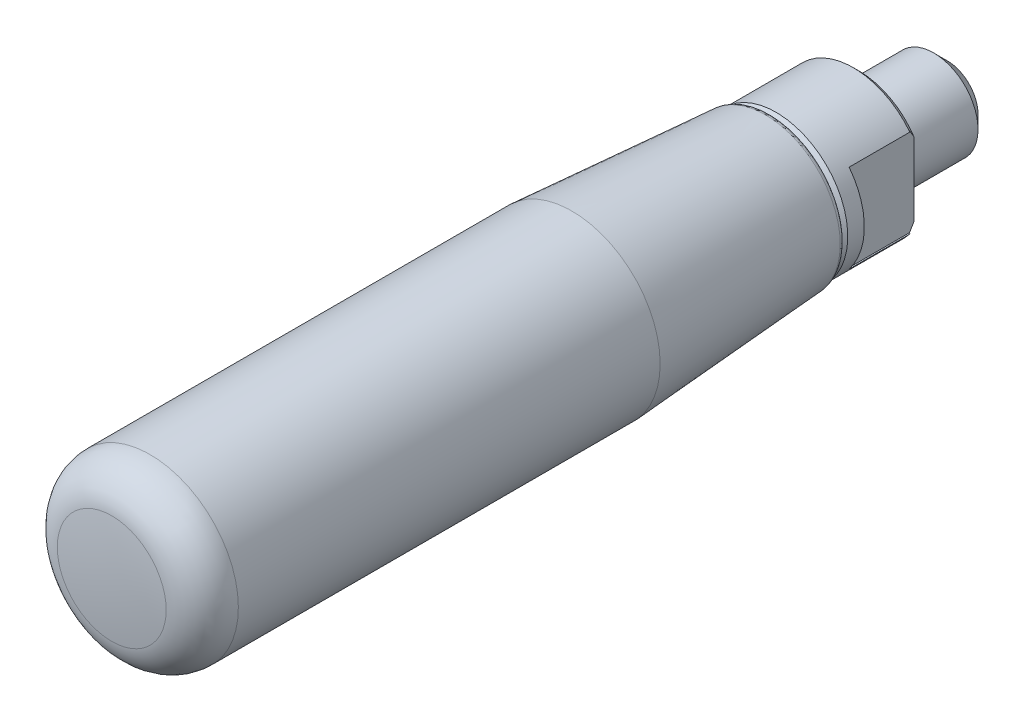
ISO-10303-21;
HEADER;
FILE_DESCRIPTION(('STEP AP214'),'2;1');
FILE_NAME('part.step','',(''),(''),'','','');
FILE_SCHEMA(('AUTOMOTIVE_DESIGN { 1 0 10303 214 1 1 1 1 }'));
ENDSEC;
DATA;
#1=APPLICATION_CONTEXT('core data for automotive mechanical design processes');
#2=APPLICATION_PROTOCOL_DEFINITION('international standard','automotive_design',2000,#1);
#3=PRODUCT_CONTEXT('',#1,'mechanical');
#4=PRODUCT('Part','Part','',(#3));
#5=PRODUCT_RELATED_PRODUCT_CATEGORY('part','',(#4));
#6=PRODUCT_DEFINITION_FORMATION('','',#4);
#7=PRODUCT_DEFINITION_CONTEXT('part definition',#1,'design');
#8=PRODUCT_DEFINITION('design','',#6,#7);
#9=PRODUCT_DEFINITION_SHAPE('','',#8);
#10=(LENGTH_UNIT() NAMED_UNIT(*) SI_UNIT(.MILLI.,.METRE.));
#11=(NAMED_UNIT(*) PLANE_ANGLE_UNIT() SI_UNIT($,.RADIAN.));
#12=(NAMED_UNIT(*) SI_UNIT($,.STERADIAN.) SOLID_ANGLE_UNIT());
#13=UNCERTAINTY_MEASURE_WITH_UNIT(LENGTH_MEASURE(1.E-05),#10,'distance_accuracy_value','');
#14=(GEOMETRIC_REPRESENTATION_CONTEXT(3) GLOBAL_UNCERTAINTY_ASSIGNED_CONTEXT((#13)) GLOBAL_UNIT_ASSIGNED_CONTEXT((#10,
#11,#12)) REPRESENTATION_CONTEXT('',''));
#15=CARTESIAN_POINT('',(0.,0.,0.));
#16=DIRECTION('',(0.,0.,1.));
#17=DIRECTION('',(1.,0.,0.));
#18=AXIS2_PLACEMENT_3D('',#15,#16,#17);
#19=CARTESIAN_POINT('',(0.,0.,28.));
#20=DIRECTION('',(0.,0.,-1.));
#21=DIRECTION('',(-0.819548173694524,0.573010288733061,0.));
#22=AXIS2_PLACEMENT_3D('',#19,#20,#21);
#23=SPHERICAL_SURFACE('',#22,40.);
#24=CARTESIAN_POINT('',(0.,0.,67.6948389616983));
#25=DIRECTION('',(0.,0.,-1.));
#26=DIRECTION('',(0.819548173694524,-0.573010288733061,0.));
#27=AXIS2_PLACEMENT_3D('',#24,#25,#26);
#28=CIRCLE('',#27,4.93150684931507);
#29=CARTESIAN_POINT('',(4.04160743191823,-2.82580416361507,67.6948389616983));
#30=VERTEX_POINT('',#29);
#31=EDGE_CURVE('E144',#30,#30,#28,.F.);
#32=ORIENTED_EDGE('',*,*,#31,.T.);
#33=EDGE_LOOP('',(#32));
#34=FACE_BOUND('',#33,.T.);
#35=ADVANCED_FACE('F15',(#34),#23,.T.);
#36=CARTESIAN_POINT('',(0.,0.,8.));
#37=DIRECTION('',(0.,0.,-1.));
#38=DIRECTION('',(0.819548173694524,-0.573010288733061,0.));
#39=AXIS2_PLACEMENT_3D('',#36,#37,#38);
#40=CYLINDRICAL_SURFACE('',#39,8.);
#41=CARTESIAN_POINT('',(0.,0.,64.2215405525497));
#42=DIRECTION('',(0.,0.,-1.));
#43=DIRECTION('',(0.819548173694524,-0.573010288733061,0.));
#44=AXIS2_PLACEMENT_3D('',#41,#42,#43);
#45=CIRCLE('',#44,8.);
#46=CARTESIAN_POINT('',(6.55638538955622,-4.58408230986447,64.2215405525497));
#47=VERTEX_POINT('',#46);
#48=EDGE_CURVE('E139',#47,#47,#45,.T.);
#49=ORIENTED_EDGE('',*,*,#48,.T.);
#50=EDGE_LOOP('',(#49));
#51=FACE_BOUND('',#50,.T.);
#52=CARTESIAN_POINT('',(0.,0.,26.));
#53=DIRECTION('',(0.,0.,-1.));
#54=DIRECTION('',(0.819548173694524,-0.573010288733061,0.));
#55=AXIS2_PLACEMENT_3D('',#52,#53,#54);
#56=CIRCLE('',#55,8.);
#57=CARTESIAN_POINT('',(6.5563853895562,-4.58408230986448,26.));
#58=VERTEX_POINT('',#57);
#59=EDGE_CURVE('E136',#58,#58,#56,.T.);
#60=ORIENTED_EDGE('',*,*,#59,.F.);
#61=EDGE_LOOP('',(#60));
#62=FACE_BOUND('',#61,.T.);
#63=ADVANCED_FACE('F494',(#51,#62),#40,.T.);
#64=CARTESIAN_POINT('',(0.,0.,26.));
#65=DIRECTION('',(0.,0.,1.));
#66=DIRECTION('',(-0.819548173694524,0.573010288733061,0.));
#67=AXIS2_PLACEMENT_3D('',#64,#65,#66);
#68=CONICAL_SURFACE('',#67,8.,0.0693331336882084);
#69=CARTESIAN_POINT('',(0.,0.,8.46536120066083));
#70=DIRECTION('',(0.,0.,-1.));
#71=DIRECTION('',(0.819548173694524,-0.573010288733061,0.));
#72=AXIS2_PLACEMENT_3D('',#69,#70,#71);
#73=CIRCLE('',#72,6.78231675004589);
#74=CARTESIAN_POINT('',(5.55843530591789,-3.88633727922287,8.46536120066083));
#75=VERTEX_POINT('',#74);
#76=EDGE_CURVE('E150',#75,#75,#73,.F.);
#77=ORIENTED_EDGE('',*,*,#76,.T.);
#78=EDGE_LOOP('',(#77));
#79=FACE_BOUND('',#78,.T.);
#80=ORIENTED_EDGE('',*,*,#59,.T.);
#81=EDGE_LOOP('',(#80));
#82=FACE_BOUND('',#81,.T.);
#83=ADVANCED_FACE('F501',(#79,#82),#68,.T.);
#84=CARTESIAN_POINT('',(-3.27819269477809,2.29204115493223,8.));
#85=DIRECTION('',(0.,0.,1.));
#86=DIRECTION('',(-0.819548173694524,0.573010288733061,0.));
#87=AXIS2_PLACEMENT_3D('',#84,#85,#86);
#88=PLANE('',#87);
#89=CARTESIAN_POINT('',(0.,0.,8.));
#90=DIRECTION('',(0.,0.,-1.));
#91=DIRECTION('',(-1.,0.,0.));
#92=AXIS2_PLACEMENT_3D('',#89,#90,#91);
#93=CIRCLE('',#92,6.);
#94=CARTESIAN_POINT('',(-6.,0.,8.));
#95=VERTEX_POINT('',#94);
#96=EDGE_CURVE('E225',#95,#95,#93,.F.);
#97=ORIENTED_EDGE('',*,*,#96,.T.);
#98=EDGE_LOOP('',(#97));
#99=FACE_BOUND('',#98,.T.);
#100=CARTESIAN_POINT('',(0.,0.,8.));
#101=DIRECTION('',(0.,0.,1.));
#102=DIRECTION('',(-0.819548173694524,0.573010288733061,0.));
#103=AXIS2_PLACEMENT_3D('',#100,#101,#102);
#104=CIRCLE('',#103,6.28351803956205);
#105=CARTESIAN_POINT('',(-5.14964573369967,3.60052048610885,8.));
#106=VERTEX_POINT('',#105);
#107=EDGE_CURVE('E147',#106,#106,#104,.F.);
#108=ORIENTED_EDGE('',*,*,#107,.T.);
#109=EDGE_LOOP('',(#108));
#110=FACE_BOUND('',#109,.T.);
#111=ADVANCED_FACE('F630',(#99,#110),#88,.F.);
#112=CARTESIAN_POINT('',(0.,0.,64.2215405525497));
#113=DIRECTION('',(0.,0.,-1.));
#114=DIRECTION('',(0.819548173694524,-0.573010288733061,0.));
#115=AXIS2_PLACEMENT_3D('',#112,#113,#114);
#116=TOROIDAL_SURFACE('',#115,4.5,3.5);
#117=ORIENTED_EDGE('',*,*,#31,.F.);
#118=EDGE_LOOP('',(#117));
#119=FACE_BOUND('',#118,.T.);
#120=ORIENTED_EDGE('',*,*,#48,.F.);
#121=EDGE_LOOP('',(#120));
#122=FACE_BOUND('',#121,.T.);
#123=ADVANCED_FACE('F620',(#119,#122),#116,.T.);
#124=CARTESIAN_POINT('',(0.,0.,8.5));
#125=DIRECTION('',(0.,0.,1.));
#126=DIRECTION('',(-0.819548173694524,0.573010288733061,0.));
#127=AXIS2_PLACEMENT_3D('',#124,#125,#126);
#128=TOROIDAL_SURFACE('',#127,6.28351803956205,0.5);
#129=ORIENTED_EDGE('',*,*,#76,.F.);
#130=EDGE_LOOP('',(#129));
#131=FACE_BOUND('',#130,.T.);
#132=ORIENTED_EDGE('',*,*,#107,.F.);
#133=EDGE_LOOP('',(#132));
#134=FACE_BOUND('',#133,.T.);
#135=ADVANCED_FACE('F346',(#131,#134),#128,.T.);
#136=CARTESIAN_POINT('',(0.,4.,-8.));
#137=DIRECTION('',(0.,0.,1.));
#138=DIRECTION('',(1.,0.,0.));
#139=AXIS2_PLACEMENT_3D('',#136,#137,#138);
#140=PLANE('',#139);
#141=CARTESIAN_POINT('',(0.,0.,-8.));
#142=DIRECTION('',(0.,0.,1.));
#143=DIRECTION('',(1.,0.,0.));
#144=AXIS2_PLACEMENT_3D('',#141,#142,#143);
#145=CIRCLE('',#144,2.8);
#146=CARTESIAN_POINT('',(2.8,0.,-8.));
#147=VERTEX_POINT('',#146);
#148=EDGE_CURVE('E448',#147,#147,#145,.F.);
#149=ORIENTED_EDGE('',*,*,#148,.T.);
#150=EDGE_LOOP('',(#149));
#151=FACE_BOUND('',#150,.T.);
#152=ADVANCED_FACE('F343',(#151),#140,.F.);
#153=CARTESIAN_POINT('',(0.,0.,-8.));
#154=DIRECTION('',(0.,0.,1.));
#155=DIRECTION('',(1.,0.,0.));
#156=AXIS2_PLACEMENT_3D('',#153,#154,#155);
#157=CONICAL_SURFACE('',#156,2.8,0.785398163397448);
#158=CARTESIAN_POINT('',(0.,0.,-6.8));
#159=DIRECTION('',(0.,0.,1.));
#160=DIRECTION('',(1.,0.,0.));
#161=AXIS2_PLACEMENT_3D('',#158,#159,#160);
#162=CIRCLE('',#161,4.);
#163=CARTESIAN_POINT('',(4.,0.,-6.8));
#164=VERTEX_POINT('',#163);
#165=EDGE_CURVE('E446',#164,#164,#162,.T.);
#166=ORIENTED_EDGE('',*,*,#165,.F.);
#167=EDGE_LOOP('',(#166));
#168=FACE_BOUND('',#167,.T.);
#169=ORIENTED_EDGE('',*,*,#148,.F.);
#170=EDGE_LOOP('',(#169));
#171=FACE_BOUND('',#170,.T.);
#172=ADVANCED_FACE('F260',(#168,#171),#157,.T.);
#173=CARTESIAN_POINT('',(0.,0.,0.));
#174=DIRECTION('',(0.,0.,-1.));
#175=DIRECTION('',(-1.,0.,0.));
#176=AXIS2_PLACEMENT_3D('',#173,#174,#175);
#177=CYLINDRICAL_SURFACE('',#176,4.);
#178=ORIENTED_EDGE('',*,*,#165,.T.);
#179=EDGE_LOOP('',(#178));
#180=FACE_BOUND('',#179,.T.);
#181=CARTESIAN_POINT('',(0.,0.,0.));
#182=DIRECTION('',(0.,0.,-1.));
#183=DIRECTION('',(-1.,0.,0.));
#184=AXIS2_PLACEMENT_3D('',#181,#182,#183);
#185=CIRCLE('',#184,4.);
#186=CARTESIAN_POINT('',(-4.,0.,0.));
#187=VERTEX_POINT('',#186);
#188=EDGE_CURVE('E192',#187,#187,#185,.T.);
#189=ORIENTED_EDGE('',*,*,#188,.T.);
#190=EDGE_LOOP('',(#189));
#191=FACE_BOUND('',#190,.T.);
#192=ADVANCED_FACE('F339',(#180,#191),#177,.T.);
#193=CARTESIAN_POINT('',(-5.,4.,6.));
#194=DIRECTION('',(-1.,0.,0.));
#195=DIRECTION('',(0.,-1.,0.));
#196=AXIS2_PLACEMENT_3D('',#193,#194,#195);
#197=PLANE('',#196);
#198=DIRECTION('',(0.,0.,-1.));
#199=VECTOR('',#198,1.);
#200=CARTESIAN_POINT('',(-5.,4.,6.));
#201=LINE('',#200,#199);
#202=CARTESIAN_POINT('',(-5.,4.,6.));
#203=VERTEX_POINT('',#202);
#204=CARTESIAN_POINT('',(-5.,4.,0.403124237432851));
#205=VERTEX_POINT('',#204);
#206=EDGE_CURVE('E173',#203,#205,#201,.T.);
#207=ORIENTED_EDGE('',*,*,#206,.T.);
#208=CARTESIAN_POINT('',(-5.,4.,0.403124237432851));
#209=CARTESIAN_POINT('',(-5.,3.94391314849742,0.368087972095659));
#210=CARTESIAN_POINT('',(-5.,3.88762458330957,0.33337321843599));
#211=CARTESIAN_POINT('',(-5.,3.77463206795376,0.264649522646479));
#212=CARTESIAN_POINT('',(-5.,3.71792819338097,0.230640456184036));
#213=CARTESIAN_POINT('',(-5.,3.60407215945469,0.163377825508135));
#214=CARTESIAN_POINT('',(-5.,3.54691999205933,0.13012427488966));
#215=CARTESIAN_POINT('',(-5.,3.43213562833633,0.0644325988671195));
#216=CARTESIAN_POINT('',(-5.,3.3745033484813,0.0319946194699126));
#217=CARTESIAN_POINT('',(-5.,3.31662479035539,0.));
#218=B_SPLINE_CURVE_WITH_KNOTS('',3,(#208,#209,#210,#211,#212,#213,#214,#215,#216,#217),
.UNSPECIFIED.,.F.,.F.,(4,2,2,2,4),(0.,0.198392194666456,0.396749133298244,0.595109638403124,
0.793505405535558),.UNSPECIFIED.);
#219=CARTESIAN_POINT('',(-5.,3.31662479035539,0.));
#220=VERTEX_POINT('',#219);
#221=EDGE_CURVE('E286',#205,#220,#218,.T.);
#222=ORIENTED_EDGE('',*,*,#221,.T.);
#223=DIRECTION('',(0.,1.,0.));
#224=VECTOR('',#223,1.);
#225=CARTESIAN_POINT('',(-5.,4.,0.));
#226=LINE('',#225,#224);
#227=CARTESIAN_POINT('',(-5.,-3.31662479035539,0.));
#228=VERTEX_POINT('',#227);
#229=EDGE_CURVE('E159',#228,#220,#226,.T.);
#230=ORIENTED_EDGE('',*,*,#229,.F.);
#231=CARTESIAN_POINT('',(-5.,-3.31662479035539,0.));
#232=CARTESIAN_POINT('',(-5.,-3.3745033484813,0.0319946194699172));
#233=CARTESIAN_POINT('',(-5.,-3.43213562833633,0.0644325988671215));
#234=CARTESIAN_POINT('',(-5.,-3.54691999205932,0.130124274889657));
#235=CARTESIAN_POINT('',(-5.,-3.60407215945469,0.16337782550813));
#236=CARTESIAN_POINT('',(-5.,-3.71792819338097,0.230640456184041));
#237=CARTESIAN_POINT('',(-5.,-3.77463206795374,0.264649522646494));
#238=CARTESIAN_POINT('',(-5.,-3.88762458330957,0.333373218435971));
#239=CARTESIAN_POINT('',(-5.,-3.94391314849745,0.368087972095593));
#240=CARTESIAN_POINT('',(-5.,-4.0000000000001,0.403124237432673));
#241=B_SPLINE_CURVE_WITH_KNOTS('',3,(#231,#232,#233,#234,#235,#236,#237,#238,#239,#240),
.UNSPECIFIED.,.F.,.F.,(4,2,2,2,4),(0.,0.198395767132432,0.396756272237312,0.595113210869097,
0.793505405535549),.UNSPECIFIED.);
#242=CARTESIAN_POINT('',(-5.,-4.,0.403124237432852));
#243=VERTEX_POINT('',#242);
#244=EDGE_CURVE('E270',#228,#243,#241,.T.);
#245=ORIENTED_EDGE('',*,*,#244,.T.);
#246=DIRECTION('',(0.,0.,-1.));
#247=VECTOR('',#246,1.);
#248=CARTESIAN_POINT('',(-5.,-4.,6.));
#249=LINE('',#248,#247);
#250=CARTESIAN_POINT('',(-5.,-4.,6.));
#251=VERTEX_POINT('',#250);
#252=EDGE_CURVE('E170',#251,#243,#249,.T.);
#253=ORIENTED_EDGE('',*,*,#252,.F.);
#254=DIRECTION('',(0.,1.,0.));
#255=VECTOR('',#254,1.);
#256=CARTESIAN_POINT('',(-5.,4.,6.));
#257=LINE('',#256,#255);
#258=EDGE_CURVE('E162',#251,#203,#257,.T.);
#259=ORIENTED_EDGE('',*,*,#258,.T.);
#260=EDGE_LOOP('',(#207,#222,#230,#245,#253,#259));
#261=FACE_BOUND('',#260,.T.);
#262=ADVANCED_FACE('F306',(#261),#197,.T.);
#263=CARTESIAN_POINT('',(0.,6.5,0.));
#264=DIRECTION('',(0.,0.,1.));
#265=DIRECTION('',(1.,0.,0.));
#266=AXIS2_PLACEMENT_3D('',#263,#264,#265);
#267=PLANE('',#266);
#268=ORIENTED_EDGE('',*,*,#188,.F.);
#269=EDGE_LOOP('',(#268));
#270=FACE_BOUND('',#269,.T.);
#271=ORIENTED_EDGE('',*,*,#229,.T.);
#272=CARTESIAN_POINT('',(0.,0.,0.));
#273=DIRECTION('',(0.,0.,1.));
#274=DIRECTION('',(1.,0.,0.));
#275=AXIS2_PLACEMENT_3D('',#272,#273,#274);
#276=CIRCLE('',#275,6.);
#277=CARTESIAN_POINT('',(5.,3.31662479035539,0.));
#278=VERTEX_POINT('',#277);
#279=EDGE_CURVE('E231',#220,#278,#276,.F.);
#280=ORIENTED_EDGE('',*,*,#279,.T.);
#281=DIRECTION('',(0.,-1.,0.));
#282=VECTOR('',#281,1.);
#283=CARTESIAN_POINT('',(5.,4.,0.));
#284=LINE('',#283,#282);
#285=CARTESIAN_POINT('',(5.,-3.31662479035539,0.));
#286=VERTEX_POINT('',#285);
#287=EDGE_CURVE('E176',#278,#286,#284,.T.);
#288=ORIENTED_EDGE('',*,*,#287,.T.);
#289=CARTESIAN_POINT('',(0.,0.,0.));
#290=DIRECTION('',(0.,0.,1.));
#291=DIRECTION('',(1.,0.,0.));
#292=AXIS2_PLACEMENT_3D('',#289,#290,#291);
#293=CIRCLE('',#292,6.);
#294=EDGE_CURVE('E228',#286,#228,#293,.F.);
#295=ORIENTED_EDGE('',*,*,#294,.T.);
#296=EDGE_LOOP('',(#271,#280,#288,#295));
#297=FACE_BOUND('',#296,.T.);
#298=ADVANCED_FACE('F335',(#270,#297),#267,.F.);
#299=CARTESIAN_POINT('',(5.,4.,6.));
#300=DIRECTION('',(1.,0.,0.));
#301=DIRECTION('',(0.,1.,0.));
#302=AXIS2_PLACEMENT_3D('',#299,#300,#301);
#303=PLANE('',#302);
#304=ORIENTED_EDGE('',*,*,#287,.F.);
#305=CARTESIAN_POINT('',(5.,3.31662479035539,0.));
#306=CARTESIAN_POINT('',(5.,3.3745033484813,0.0319946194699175));
#307=CARTESIAN_POINT('',(5.,3.43213562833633,0.0644325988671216));
#308=CARTESIAN_POINT('',(5.,3.54691999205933,0.130124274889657));
#309=CARTESIAN_POINT('',(5.,3.60407215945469,0.16337782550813));
#310=CARTESIAN_POINT('',(5.,3.71792819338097,0.230640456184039));
#311=CARTESIAN_POINT('',(5.,3.77463206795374,0.264649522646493));
#312=CARTESIAN_POINT('',(5.,3.88762458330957,0.333373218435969));
#313=CARTESIAN_POINT('',(5.,3.94391314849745,0.368087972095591));
#314=CARTESIAN_POINT('',(5.,4.0000000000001,0.403124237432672));
#315=B_SPLINE_CURVE_WITH_KNOTS('',3,(#305,#306,#307,#308,#309,#310,#311,#312,#313,#314),
.UNSPECIFIED.,.F.,.F.,(4,2,2,2,4),(0.,0.198395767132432,0.396756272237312,0.595113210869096,
0.793505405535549),.UNSPECIFIED.);
#316=CARTESIAN_POINT('',(5.,4.,0.403124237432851));
#317=VERTEX_POINT('',#316);
#318=EDGE_CURVE('E242',#278,#317,#315,.T.);
#319=ORIENTED_EDGE('',*,*,#318,.T.);
#320=DIRECTION('',(0.,0.,-1.));
#321=VECTOR('',#320,1.);
#322=CARTESIAN_POINT('',(5.,4.,6.));
#323=LINE('',#322,#321);
#324=CARTESIAN_POINT('',(5.,4.,6.));
#325=VERTEX_POINT('',#324);
#326=EDGE_CURVE('E189',#325,#317,#323,.T.);
#327=ORIENTED_EDGE('',*,*,#326,.F.);
#328=DIRECTION('',(0.,-1.,0.));
#329=VECTOR('',#328,1.);
#330=CARTESIAN_POINT('',(5.,4.,6.));
#331=LINE('',#330,#329);
#332=CARTESIAN_POINT('',(5.,-4.,6.));
#333=VERTEX_POINT('',#332);
#334=EDGE_CURVE('E181',#325,#333,#331,.T.);
#335=ORIENTED_EDGE('',*,*,#334,.T.);
#336=DIRECTION('',(0.,0.,-1.));
#337=VECTOR('',#336,1.);
#338=CARTESIAN_POINT('',(5.,-4.,6.));
#339=LINE('',#338,#337);
#340=CARTESIAN_POINT('',(5.,-4.,0.403124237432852));
#341=VERTEX_POINT('',#340);
#342=EDGE_CURVE('E186',#333,#341,#339,.T.);
#343=ORIENTED_EDGE('',*,*,#342,.T.);
#344=CARTESIAN_POINT('',(5.,-4.,0.403124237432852));
#345=CARTESIAN_POINT('',(5.,-3.94391314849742,0.36808797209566));
#346=CARTESIAN_POINT('',(5.,-3.88762458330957,0.333373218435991));
#347=CARTESIAN_POINT('',(5.,-3.77463206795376,0.264649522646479));
#348=CARTESIAN_POINT('',(5.,-3.71792819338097,0.230640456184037));
#349=CARTESIAN_POINT('',(5.,-3.60407215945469,0.163377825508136));
#350=CARTESIAN_POINT('',(5.,-3.54691999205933,0.130124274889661));
#351=CARTESIAN_POINT('',(5.,-3.43213562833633,0.0644325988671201));
#352=CARTESIAN_POINT('',(5.,-3.3745033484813,0.0319946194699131));
#353=CARTESIAN_POINT('',(5.,-3.31662479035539,0.));
#354=B_SPLINE_CURVE_WITH_KNOTS('',3,(#344,#345,#346,#347,#348,#349,#350,#351,#352,#353),
.UNSPECIFIED.,.F.,.F.,(4,2,2,2,4),(0.,0.198392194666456,0.396749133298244,0.595109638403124,
0.793505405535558),.UNSPECIFIED.);
#355=EDGE_CURVE('E234',#341,#286,#354,.T.);
#356=ORIENTED_EDGE('',*,*,#355,.T.);
#357=EDGE_LOOP('',(#304,#319,#327,#335,#343,#356));
#358=FACE_BOUND('',#357,.T.);
#359=ADVANCED_FACE('F249',(#358),#303,.T.);
#360=CARTESIAN_POINT('',(5.,4.,6.));
#361=DIRECTION('',(0.,0.,-1.));
#362=DIRECTION('',(0.,-1.,0.));
#363=AXIS2_PLACEMENT_3D('',#360,#361,#362);
#364=PLANE('',#363);
#365=CARTESIAN_POINT('',(0.,0.,6.));
#366=DIRECTION('',(0.,0.,-1.));
#367=DIRECTION('',(0.,-1.,0.));
#368=AXIS2_PLACEMENT_3D('',#365,#366,#367);
#369=CIRCLE('',#368,6.5);
#370=CARTESIAN_POINT('',(5.1234753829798,4.,6.));
#371=VERTEX_POINT('',#370);
#372=CARTESIAN_POINT('',(5.1234753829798,-4.,6.));
#373=VERTEX_POINT('',#372);
#374=EDGE_CURVE('E204',#371,#373,#369,.T.);
#375=ORIENTED_EDGE('',*,*,#374,.T.);
#376=DIRECTION('',(1.,0.,0.));
#377=VECTOR('',#376,1.);
#378=CARTESIAN_POINT('',(5.,-4.,6.));
#379=LINE('',#378,#377);
#380=EDGE_CURVE('E183',#333,#373,#379,.T.);
#381=ORIENTED_EDGE('',*,*,#380,.F.);
#382=ORIENTED_EDGE('',*,*,#334,.F.);
#383=DIRECTION('',(-1.,0.,0.));
#384=VECTOR('',#383,1.);
#385=CARTESIAN_POINT('',(5.,4.,6.));
#386=LINE('',#385,#384);
#387=EDGE_CURVE('E179',#371,#325,#386,.T.);
#388=ORIENTED_EDGE('',*,*,#387,.F.);
#389=EDGE_LOOP('',(#375,#381,#382,#388));
#390=FACE_BOUND('',#389,.T.);
#391=ADVANCED_FACE('F486',(#390),#364,.T.);
#392=CARTESIAN_POINT('',(5.,-4.,6.));
#393=DIRECTION('',(0.,1.,0.));
#394=DIRECTION('',(0.,0.,-1.));
#395=AXIS2_PLACEMENT_3D('',#392,#393,#394);
#396=PLANE('',#395);
#397=DIRECTION('',(0.,0.,-1.));
#398=VECTOR('',#397,1.);
#399=CARTESIAN_POINT('',(5.1234753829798,-4.,0.));
#400=LINE('',#399,#398);
#401=CARTESIAN_POINT('',(5.1234753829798,-4.,0.5));
#402=VERTEX_POINT('',#401);
#403=EDGE_CURVE('E206',#373,#402,#400,.T.);
#404=ORIENTED_EDGE('',*,*,#403,.T.);
#405=CARTESIAN_POINT('',(5.1234753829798,-4.,0.5));
#406=CARTESIAN_POINT('',(5.10293291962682,-4.,0.483807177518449));
#407=CARTESIAN_POINT('',(5.08237207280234,-4.,0.467637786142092));
#408=CARTESIAN_POINT('',(5.04121361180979,-4.,0.435345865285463));
#409=CARTESIAN_POINT('',(5.020615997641,-4.,0.419223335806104));
#410=CARTESIAN_POINT('',(5.,-4.,0.403124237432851));
#411=B_SPLINE_CURVE_WITH_KNOTS('',3,(#405,#406,#407,#408,#409,#410),.UNSPECIFIED.,.F.,.F.,(4,2,
4),(0.,0.0784715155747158,0.156943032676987),.UNSPECIFIED.);
#412=EDGE_CURVE('E285',#402,#341,#411,.T.);
#413=ORIENTED_EDGE('',*,*,#412,.T.);
#414=ORIENTED_EDGE('',*,*,#342,.F.);
#415=ORIENTED_EDGE('',*,*,#380,.T.);
#416=EDGE_LOOP('',(#404,#413,#414,#415));
#417=FACE_BOUND('',#416,.T.);
#418=ADVANCED_FACE('F258',(#417),#396,.T.);
#419=CARTESIAN_POINT('',(0.,0.,0.));
#420=DIRECTION('',(0.,0.,1.));
#421=DIRECTION('',(1.,0.,0.));
#422=AXIS2_PLACEMENT_3D('',#419,#420,#421);
#423=CONICAL_SURFACE('',#422,6.,0.785398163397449);
#424=ORIENTED_EDGE('',*,*,#412,.F.);
#425=CARTESIAN_POINT('',(0.,0.,0.5));
#426=DIRECTION('',(0.,0.,1.));
#427=DIRECTION('',(1.,0.,0.));
#428=AXIS2_PLACEMENT_3D('',#425,#426,#427);
#429=CIRCLE('',#428,6.5);
#430=CARTESIAN_POINT('',(-5.1234753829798,-4.,0.5));
#431=VERTEX_POINT('',#430);
#432=EDGE_CURVE('E218',#431,#402,#429,.T.);
#433=ORIENTED_EDGE('',*,*,#432,.F.);
#434=CARTESIAN_POINT('',(-5.,-4.,0.403124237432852));
#435=CARTESIAN_POINT('',(-5.020615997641,-4.,0.419223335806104));
#436=CARTESIAN_POINT('',(-5.04121361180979,-4.,0.435345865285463));
#437=CARTESIAN_POINT('',(-5.08237207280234,-4.,0.467637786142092));
#438=CARTESIAN_POINT('',(-5.10293291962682,-4.,0.483807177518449));
#439=CARTESIAN_POINT('',(-5.1234753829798,-4.,0.5));
#440=B_SPLINE_CURVE_WITH_KNOTS('',3,(#434,#435,#436,#437,#438,#439),.UNSPECIFIED.,.F.,.F.,(4,2,
4),(0.,0.0784715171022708,0.156943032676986),.UNSPECIFIED.);
#441=EDGE_CURVE('E279',#243,#431,#440,.T.);
#442=ORIENTED_EDGE('',*,*,#441,.F.);
#443=ORIENTED_EDGE('',*,*,#244,.F.);
#444=ORIENTED_EDGE('',*,*,#294,.F.);
#445=ORIENTED_EDGE('',*,*,#355,.F.);
#446=EDGE_LOOP('',(#424,#433,#442,#443,#444,#445));
#447=FACE_BOUND('',#446,.T.);
#448=ADVANCED_FACE('F253',(#447),#423,.T.);
#449=CARTESIAN_POINT('',(-5.,-4.,6.));
#450=DIRECTION('',(0.,1.,0.));
#451=DIRECTION('',(0.,0.,-1.));
#452=AXIS2_PLACEMENT_3D('',#449,#450,#451);
#453=PLANE('',#452);
#454=ORIENTED_EDGE('',*,*,#252,.T.);
#455=ORIENTED_EDGE('',*,*,#441,.T.);
#456=DIRECTION('',(0.,0.,-1.));
#457=VECTOR('',#456,1.);
#458=CARTESIAN_POINT('',(-5.1234753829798,-4.,0.));
#459=LINE('',#458,#457);
#460=CARTESIAN_POINT('',(-5.1234753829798,-4.,6.));
#461=VERTEX_POINT('',#460);
#462=EDGE_CURVE('E213',#431,#461,#459,.F.);
#463=ORIENTED_EDGE('',*,*,#462,.T.);
#464=DIRECTION('',(1.,0.,0.));
#465=VECTOR('',#464,1.);
#466=CARTESIAN_POINT('',(-5.,-4.,6.));
#467=LINE('',#466,#465);
#468=EDGE_CURVE('E168',#461,#251,#467,.T.);
#469=ORIENTED_EDGE('',*,*,#468,.T.);
#470=EDGE_LOOP('',(#454,#455,#463,#469));
#471=FACE_BOUND('',#470,.T.);
#472=ADVANCED_FACE('F257',(#471),#453,.T.);
#473=CARTESIAN_POINT('',(-5.,-4.,6.));
#474=DIRECTION('',(0.,0.,-1.));
#475=DIRECTION('',(0.,-1.,0.));
#476=AXIS2_PLACEMENT_3D('',#473,#474,#475);
#477=PLANE('',#476);
#478=CARTESIAN_POINT('',(0.,0.,6.));
#479=DIRECTION('',(0.,0.,-1.));
#480=DIRECTION('',(0.,-1.,0.));
#481=AXIS2_PLACEMENT_3D('',#478,#479,#480);
#482=CIRCLE('',#481,6.5);
#483=CARTESIAN_POINT('',(-5.1234753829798,4.,6.));
#484=VERTEX_POINT('',#483);
#485=EDGE_CURVE('E211',#461,#484,#482,.T.);
#486=ORIENTED_EDGE('',*,*,#485,.T.);
#487=DIRECTION('',(-1.,0.,0.));
#488=VECTOR('',#487,1.);
#489=CARTESIAN_POINT('',(-5.,4.,6.));
#490=LINE('',#489,#488);
#491=EDGE_CURVE('E165',#203,#484,#490,.T.);
#492=ORIENTED_EDGE('',*,*,#491,.F.);
#493=ORIENTED_EDGE('',*,*,#258,.F.);
#494=ORIENTED_EDGE('',*,*,#468,.F.);
#495=EDGE_LOOP('',(#486,#492,#493,#494));
#496=FACE_BOUND('',#495,.T.);
#497=ADVANCED_FACE('F300',(#496),#477,.T.);
#498=CARTESIAN_POINT('',(-5.,4.,6.));
#499=DIRECTION('',(0.,-1.,0.));
#500=DIRECTION('',(0.,0.,1.));
#501=AXIS2_PLACEMENT_3D('',#498,#499,#500);
#502=PLANE('',#501);
#503=DIRECTION('',(0.,0.,-1.));
#504=VECTOR('',#503,1.);
#505=CARTESIAN_POINT('',(-5.1234753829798,4.,0.));
#506=LINE('',#505,#504);
#507=CARTESIAN_POINT('',(-5.1234753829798,4.,0.5));
#508=VERTEX_POINT('',#507);
#509=EDGE_CURVE('E215',#484,#508,#506,.T.);
#510=ORIENTED_EDGE('',*,*,#509,.T.);
#511=CARTESIAN_POINT('',(-5.1234753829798,4.,0.5));
#512=CARTESIAN_POINT('',(-5.10293291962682,4.,0.483807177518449));
#513=CARTESIAN_POINT('',(-5.08237207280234,4.,0.467637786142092));
#514=CARTESIAN_POINT('',(-5.04121361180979,4.,0.435345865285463));
#515=CARTESIAN_POINT('',(-5.020615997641,4.,0.419223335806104));
#516=CARTESIAN_POINT('',(-5.,4.,0.403124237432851));
#517=B_SPLINE_CURVE_WITH_KNOTS('',3,(#511,#512,#513,#514,#515,#516),.UNSPECIFIED.,.F.,.F.,(4,2,
4),(0.,0.0784715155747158,0.156943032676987),.UNSPECIFIED.);
#518=EDGE_CURVE('E309',#508,#205,#517,.T.);
#519=ORIENTED_EDGE('',*,*,#518,.T.);
#520=ORIENTED_EDGE('',*,*,#206,.F.);
#521=ORIENTED_EDGE('',*,*,#491,.T.);
#522=EDGE_LOOP('',(#510,#519,#520,#521));
#523=FACE_BOUND('',#522,.T.);
#524=ADVANCED_FACE('F302',(#523),#502,.T.);
#525=CARTESIAN_POINT('',(0.,0.,0.));
#526=DIRECTION('',(0.,0.,1.));
#527=DIRECTION('',(1.,0.,0.));
#528=AXIS2_PLACEMENT_3D('',#525,#526,#527);
#529=CONICAL_SURFACE('',#528,6.,0.785398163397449);
#530=ORIENTED_EDGE('',*,*,#518,.F.);
#531=CARTESIAN_POINT('',(0.,0.,0.5));
#532=DIRECTION('',(0.,0.,1.));
#533=DIRECTION('',(1.,0.,0.));
#534=AXIS2_PLACEMENT_3D('',#531,#532,#533);
#535=CIRCLE('',#534,6.5);
#536=CARTESIAN_POINT('',(5.1234753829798,4.,0.5));
#537=VERTEX_POINT('',#536);
#538=EDGE_CURVE('E220',#537,#508,#535,.T.);
#539=ORIENTED_EDGE('',*,*,#538,.F.);
#540=CARTESIAN_POINT('',(5.,4.,0.403124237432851));
#541=CARTESIAN_POINT('',(5.020615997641,4.,0.419223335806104));
#542=CARTESIAN_POINT('',(5.04121361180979,4.,0.435345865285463));
#543=CARTESIAN_POINT('',(5.08237207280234,4.,0.467637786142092));
#544=CARTESIAN_POINT('',(5.10293291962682,4.,0.483807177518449));
#545=CARTESIAN_POINT('',(5.1234753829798,4.,0.5));
#546=B_SPLINE_CURVE_WITH_KNOTS('',3,(#540,#541,#542,#543,#544,#545),.UNSPECIFIED.,.F.,.F.,(4,2,
4),(0.,0.078471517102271,0.156943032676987),.UNSPECIFIED.);
#547=EDGE_CURVE('E314',#317,#537,#546,.T.);
#548=ORIENTED_EDGE('',*,*,#547,.F.);
#549=ORIENTED_EDGE('',*,*,#318,.F.);
#550=ORIENTED_EDGE('',*,*,#279,.F.);
#551=ORIENTED_EDGE('',*,*,#221,.F.);
#552=EDGE_LOOP('',(#530,#539,#548,#549,#550,#551));
#553=FACE_BOUND('',#552,.T.);
#554=ADVANCED_FACE('F262',(#553),#529,.T.);
#555=CARTESIAN_POINT('',(5.,4.,6.));
#556=DIRECTION('',(0.,-1.,0.));
#557=DIRECTION('',(0.,0.,1.));
#558=AXIS2_PLACEMENT_3D('',#555,#556,#557);
#559=PLANE('',#558);
#560=ORIENTED_EDGE('',*,*,#326,.T.);
#561=ORIENTED_EDGE('',*,*,#547,.T.);
#562=DIRECTION('',(0.,0.,-1.));
#563=VECTOR('',#562,1.);
#564=CARTESIAN_POINT('',(5.1234753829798,4.,0.));
#565=LINE('',#564,#563);
#566=EDGE_CURVE('E209',#537,#371,#565,.F.);
#567=ORIENTED_EDGE('',*,*,#566,.T.);
#568=ORIENTED_EDGE('',*,*,#387,.T.);
#569=EDGE_LOOP('',(#560,#561,#567,#568));
#570=FACE_BOUND('',#569,.T.);
#571=ADVANCED_FACE('F319',(#570),#559,.T.);
#572=CARTESIAN_POINT('',(0.,0.,0.));
#573=DIRECTION('',(0.,0.,-1.));
#574=DIRECTION('',(-1.,0.,0.));
#575=AXIS2_PLACEMENT_3D('',#572,#573,#574);
#576=CYLINDRICAL_SURFACE('',#575,6.5);
#577=CARTESIAN_POINT('',(0.,0.,7.5));
#578=DIRECTION('',(0.,0.,-1.));
#579=DIRECTION('',(-1.,0.,0.));
#580=AXIS2_PLACEMENT_3D('',#577,#578,#579);
#581=CIRCLE('',#580,6.5);
#582=CARTESIAN_POINT('',(-6.5,0.,7.5));
#583=VERTEX_POINT('',#582);
#584=EDGE_CURVE('E222',#583,#583,#581,.T.);
#585=ORIENTED_EDGE('',*,*,#584,.T.);
#586=EDGE_LOOP('',(#585));
#587=FACE_BOUND('',#586,.T.);
#588=ORIENTED_EDGE('',*,*,#566,.F.);
#589=ORIENTED_EDGE('',*,*,#538,.T.);
#590=ORIENTED_EDGE('',*,*,#509,.F.);
#591=ORIENTED_EDGE('',*,*,#485,.F.);
#592=ORIENTED_EDGE('',*,*,#462,.F.);
#593=ORIENTED_EDGE('',*,*,#432,.T.);
#594=ORIENTED_EDGE('',*,*,#403,.F.);
#595=ORIENTED_EDGE('',*,*,#374,.F.);
#596=EDGE_LOOP('',(#588,#589,#590,#591,#592,#593,#594,#595));
#597=FACE_BOUND('',#596,.T.);
#598=ADVANCED_FACE('F323',(#587,#597),#576,.T.);
#599=CARTESIAN_POINT('',(0.,0.,7.5));
#600=DIRECTION('',(0.,0.,-1.));
#601=DIRECTION('',(-1.,0.,0.));
#602=AXIS2_PLACEMENT_3D('',#599,#600,#601);
#603=CONICAL_SURFACE('',#602,6.5,0.785398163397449);
#604=ORIENTED_EDGE('',*,*,#96,.F.);
#605=EDGE_LOOP('',(#604));
#606=FACE_BOUND('',#605,.T.);
#607=ORIENTED_EDGE('',*,*,#584,.F.);
#608=EDGE_LOOP('',(#607));
#609=FACE_BOUND('',#608,.T.);
#610=ADVANCED_FACE('F333',(#606,#609),#603,.T.);
#611=CLOSED_SHELL('',(#35,#63,#83,#111,#123,#135,#152,#172,#192,#262,#298,#359,#391,#418,#448,
#472,#497,#524,#554,#571,#598,#610));
#612=CARTESIAN_POINT('',(0.,0.,35.));
#613=DIRECTION('',(0.,0.,-1.));
#614=DIRECTION('',(0.417533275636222,0.90866163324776,0.));
#615=AXIS2_PLACEMENT_3D('',#612,#613,#614);
#616=CYLINDRICAL_SURFACE('',#615,2.4);
#617=CARTESIAN_POINT('',(0.,0.,35.));
#618=DIRECTION('',(0.,0.,-1.));
#619=DIRECTION('',(0.417533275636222,0.90866163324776,0.));
#620=AXIS2_PLACEMENT_3D('',#617,#618,#619);
#621=CIRCLE('',#620,2.4);
#622=CARTESIAN_POINT('',(1.70653881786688,-1.68752044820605,35.));
#623=VERTEX_POINT('',#622);
#624=CARTESIAN_POINT('',(2.18078791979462,-1.00207986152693,35.));
#625=VERTEX_POINT('',#624);
#626=EDGE_CURVE('E9',#623,#625,#621,.T.);
#627=ORIENTED_EDGE('',*,*,#626,.T.);
#628=DIRECTION('',(0.,0.,1.));
#629=VECTOR('',#628,1.);
#630=CARTESIAN_POINT('',(2.18078791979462,-1.00207986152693,35.));
#631=LINE('',#630,#629);
#632=CARTESIAN_POINT('',(2.18078791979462,-1.00207986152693,51.));
#633=VERTEX_POINT('',#632);
#634=EDGE_CURVE('E422',#625,#633,#631,.T.);
#635=ORIENTED_EDGE('',*,*,#634,.T.);
#636=CARTESIAN_POINT('',(0.,0.,51.));
#637=DIRECTION('',(0.,0.,-1.));
#638=DIRECTION('',(0.417533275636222,0.90866163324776,0.));
#639=AXIS2_PLACEMENT_3D('',#636,#637,#638);
#640=CIRCLE('',#639,2.4);
#641=CARTESIAN_POINT('',(1.70653881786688,-1.68752044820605,51.));
#642=VERTEX_POINT('',#641);
#643=EDGE_CURVE('E394',#642,#633,#640,.T.);
#644=ORIENTED_EDGE('',*,*,#643,.F.);
#645=DIRECTION('',(0.,0.,1.));
#646=VECTOR('',#645,1.);
#647=CARTESIAN_POINT('',(1.70653881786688,-1.68752044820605,35.));
#648=LINE('',#647,#646);
#649=EDGE_CURVE('E400',#623,#642,#648,.T.);
#650=ORIENTED_EDGE('',*,*,#649,.F.);
#651=EDGE_LOOP('',(#627,#635,#644,#650));
#652=FACE_BOUND('',#651,.T.);
#653=ADVANCED_FACE('F380',(#652),#616,.F.);
#654=CARTESIAN_POINT('',(1.70653881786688,-1.68752044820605,35.));
#655=DIRECTION('',(0.,0.,1.));
#656=DIRECTION('',(-0.417533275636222,-0.90866163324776,0.));
#657=AXIS2_PLACEMENT_3D('',#654,#655,#656);
#658=PLANE('',#657);
#659=DIRECTION('',(-0.90866163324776,0.417533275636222,0.));
#660=VECTOR('',#659,1.);
#661=CARTESIAN_POINT('',(2.18078791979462,-1.00207986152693,35.));
#662=LINE('',#661,#660);
#663=CARTESIAN_POINT('',(3.63464653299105,-1.67013310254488,35.));
#664=VERTEX_POINT('',#663);
#665=CARTESIAN_POINT('',(3.13488263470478,-1.44048980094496,35.));
#666=VERTEX_POINT('',#665);
#667=EDGE_CURVE('E406',#664,#666,#662,.T.);
#668=ORIENTED_EDGE('',*,*,#667,.T.);
#669=CARTESIAN_POINT('',(0.,0.,35.));
#670=DIRECTION('',(0.,0.,-1.));
#671=DIRECTION('',(-1.,0.,0.));
#672=AXIS2_PLACEMENT_3D('',#669,#670,#671);
#673=CIRCLE('',#672,3.45);
#674=CARTESIAN_POINT('',(2.45314955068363,-2.42581064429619,35.));
#675=VERTEX_POINT('',#674);
#676=EDGE_CURVE('E31',#666,#675,#673,.F.);
#677=ORIENTED_EDGE('',*,*,#676,.T.);
#678=DIRECTION('',(-0.711057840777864,0.703133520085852,0.));
#679=VECTOR('',#678,1.);
#680=CARTESIAN_POINT('',(1.70653881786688,-1.68752044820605,35.));
#681=LINE('',#680,#679);
#682=CARTESIAN_POINT('',(2.84423136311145,-2.81253408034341,35.));
#683=VERTEX_POINT('',#682);
#684=EDGE_CURVE('E412',#683,#675,#681,.T.);
#685=ORIENTED_EDGE('',*,*,#684,.F.);
#686=CARTESIAN_POINT('',(0.,0.,35.));
#687=DIRECTION('',(0.,0.,-1.));
#688=DIRECTION('',(0.417533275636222,0.90866163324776,0.));
#689=AXIS2_PLACEMENT_3D('',#686,#687,#688);
#690=CIRCLE('',#689,4.);
#691=EDGE_CURVE('E24',#683,#664,#690,.T.);
#692=ORIENTED_EDGE('',*,*,#691,.T.);
#693=EDGE_LOOP('',(#668,#677,#685,#692));
#694=FACE_BOUND('',#693,.T.);
#695=ADVANCED_FACE('F17',(#694),#658,.F.);
#696=CARTESIAN_POINT('',(2.84423136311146,-2.81253408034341,51.));
#697=DIRECTION('',(0.,0.,-1.));
#698=DIRECTION('',(0.417533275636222,0.90866163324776,0.));
#699=AXIS2_PLACEMENT_3D('',#696,#697,#698);
#700=PLANE('',#699);
#701=DIRECTION('',(0.711057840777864,-0.703133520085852,0.));
#702=VECTOR('',#701,1.);
#703=CARTESIAN_POINT('',(2.84423136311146,-2.81253408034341,51.));
#704=LINE('',#703,#702);
#705=CARTESIAN_POINT('',(2.84423136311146,-2.81253408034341,51.));
#706=VERTEX_POINT('',#705);
#707=EDGE_CURVE('E392',#642,#706,#704,.T.);
#708=ORIENTED_EDGE('',*,*,#707,.F.);
#709=ORIENTED_EDGE('',*,*,#643,.T.);
#710=DIRECTION('',(0.90866163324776,-0.417533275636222,0.));
#711=VECTOR('',#710,1.);
#712=CARTESIAN_POINT('',(3.63464653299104,-1.67013310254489,51.));
#713=LINE('',#712,#711);
#714=CARTESIAN_POINT('',(3.63464653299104,-1.67013310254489,51.));
#715=VERTEX_POINT('',#714);
#716=EDGE_CURVE('E421',#633,#715,#713,.T.);
#717=ORIENTED_EDGE('',*,*,#716,.T.);
#718=CARTESIAN_POINT('',(0.,0.,51.));
#719=DIRECTION('',(0.,0.,-1.));
#720=DIRECTION('',(0.417533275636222,0.90866163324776,0.));
#721=AXIS2_PLACEMENT_3D('',#718,#719,#720);
#722=CIRCLE('',#721,4.);
#723=EDGE_CURVE('E397',#706,#715,#722,.T.);
#724=ORIENTED_EDGE('',*,*,#723,.F.);
#725=EDGE_LOOP('',(#708,#709,#717,#724));
#726=FACE_BOUND('',#725,.T.);
#727=ADVANCED_FACE('F376',(#726),#700,.F.);
#728=CARTESIAN_POINT('',(1.70653881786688,-1.68752044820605,51.));
#729=DIRECTION('',(-0.703133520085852,-0.711057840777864,0.));
#730=DIRECTION('',(0.,0.,-1.));
#731=AXIS2_PLACEMENT_3D('',#728,#729,#730);
#732=PLANE('',#731);
#733=ORIENTED_EDGE('',*,*,#649,.T.);
#734=ORIENTED_EDGE('',*,*,#707,.T.);
#735=DIRECTION('',(0.,0.,-1.));
#736=VECTOR('',#735,1.);
#737=CARTESIAN_POINT('',(2.84423136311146,-2.81253408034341,51.));
#738=LINE('',#737,#736);
#739=EDGE_CURVE('E399',#706,#683,#738,.T.);
#740=ORIENTED_EDGE('',*,*,#739,.T.);
#741=ORIENTED_EDGE('',*,*,#684,.T.);
#742=DIRECTION('',(0.711057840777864,-0.703133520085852,0.));
#743=VECTOR('',#742,1.);
#744=CARTESIAN_POINT('',(1.70653881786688,-1.68752044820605,35.));
#745=LINE('',#744,#743);
#746=EDGE_CURVE('E404',#623,#675,#745,.T.);
#747=ORIENTED_EDGE('',*,*,#746,.F.);
#748=EDGE_LOOP('',(#733,#734,#740,#741,#747));
#749=FACE_BOUND('',#748,.T.);
#750=ADVANCED_FACE('F375',(#749),#732,.F.);
#751=CARTESIAN_POINT('',(2.18078791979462,-1.00207986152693,51.));
#752=DIRECTION('',(-0.417533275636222,-0.90866163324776,0.));
#753=DIRECTION('',(0.,0.,-1.));
#754=AXIS2_PLACEMENT_3D('',#751,#752,#753);
#755=PLANE('',#754);
#756=ORIENTED_EDGE('',*,*,#634,.F.);
#757=EDGE_CURVE('E39',#666,#625,#662,.T.);
#758=ORIENTED_EDGE('',*,*,#757,.F.);
#759=ORIENTED_EDGE('',*,*,#667,.F.);
#760=DIRECTION('',(0.,0.,-1.));
#761=VECTOR('',#760,1.);
#762=CARTESIAN_POINT('',(3.63464653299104,-1.67013310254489,51.));
#763=LINE('',#762,#761);
#764=EDGE_CURVE('E420',#715,#664,#763,.T.);
#765=ORIENTED_EDGE('',*,*,#764,.F.);
#766=ORIENTED_EDGE('',*,*,#716,.F.);
#767=EDGE_LOOP('',(#756,#758,#759,#765,#766));
#768=FACE_BOUND('',#767,.T.);
#769=ADVANCED_FACE('F368',(#768),#755,.T.);
#770=CARTESIAN_POINT('',(0.,3.95,35.));
#771=DIRECTION('',(0.,0.,-1.));
#772=DIRECTION('',(-1.,0.,0.));
#773=AXIS2_PLACEMENT_3D('',#770,#771,#772);
#774=PLANE('',#773);
#775=CARTESIAN_POINT('',(0.,0.,35.));
#776=DIRECTION('',(0.,0.,-1.));
#777=DIRECTION('',(-1.,0.,0.));
#778=AXIS2_PLACEMENT_3D('',#775,#776,#777);
#779=CIRCLE('',#778,2.);
#780=CARTESIAN_POINT('',(-2.,0.,35.));
#781=VERTEX_POINT('',#780);
#782=EDGE_CURVE('E201',#781,#781,#779,.T.);
#783=ORIENTED_EDGE('',*,*,#782,.T.);
#784=EDGE_LOOP('',(#783));
#785=FACE_BOUND('',#784,.T.);
#786=ORIENTED_EDGE('',*,*,#626,.F.);
#787=ORIENTED_EDGE('',*,*,#746,.T.);
#788=EDGE_CURVE('E428',#675,#666,#673,.F.);
#789=ORIENTED_EDGE('',*,*,#788,.T.);
#790=ORIENTED_EDGE('',*,*,#757,.T.);
#791=EDGE_LOOP('',(#786,#787,#789,#790));
#792=FACE_BOUND('',#791,.T.);
#793=ADVANCED_FACE('F364',(#785,#792),#774,.F.);
#794=CARTESIAN_POINT('',(0.,0.,8.));
#795=DIRECTION('',(0.,0.,-1.));
#796=DIRECTION('',(0.819548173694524,-0.573010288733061,0.));
#797=AXIS2_PLACEMENT_3D('',#794,#795,#796);
#798=CYLINDRICAL_SURFACE('',#797,4.);
#799=CARTESIAN_POINT('',(0.,0.,55.));
#800=DIRECTION('',(0.,0.,-1.));
#801=DIRECTION('',(0.819548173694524,-0.573010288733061,0.));
#802=AXIS2_PLACEMENT_3D('',#799,#800,#801);
#803=CIRCLE('',#802,4.);
#804=CARTESIAN_POINT('',(3.27819269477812,-2.29204115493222,55.));
#805=VERTEX_POINT('',#804);
#806=EDGE_CURVE('E134',#805,#805,#803,.T.);
#807=ORIENTED_EDGE('',*,*,#806,.F.);
#808=EDGE_LOOP('',(#807));
#809=FACE_BOUND('',#808,.T.);
#810=CARTESIAN_POINT('',(0.,0.,9.));
#811=DIRECTION('',(0.,0.,1.));
#812=DIRECTION('',(-0.819548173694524,0.573010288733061,0.));
#813=AXIS2_PLACEMENT_3D('',#810,#811,#812);
#814=CIRCLE('',#813,4.);
#815=CARTESIAN_POINT('',(-3.27819269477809,2.29204115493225,9.));
#816=VERTEX_POINT('',#815);
#817=EDGE_CURVE('E153',#816,#816,#814,.F.);
#818=ORIENTED_EDGE('',*,*,#817,.T.);
#819=EDGE_LOOP('',(#818));
#820=FACE_BOUND('',#819,.T.);
#821=ORIENTED_EDGE('',*,*,#691,.F.);
#822=ORIENTED_EDGE('',*,*,#739,.F.);
#823=ORIENTED_EDGE('',*,*,#723,.T.);
#824=ORIENTED_EDGE('',*,*,#764,.T.);
#825=EDGE_LOOP('',(#821,#822,#823,#824));
#826=FACE_BOUND('',#825,.T.);
#827=ADVANCED_FACE('F367',(#809,#820,#826),#798,.F.);
#828=CARTESIAN_POINT('',(0.,0.,0.));
#829=DIRECTION('',(0.,0.,-1.));
#830=DIRECTION('',(-1.,0.,0.));
#831=AXIS2_PLACEMENT_3D('',#828,#829,#830);
#832=CYLINDRICAL_SURFACE('',#831,3.95);
#833=CARTESIAN_POINT('',(0.,0.,34.5));
#834=DIRECTION('',(0.,0.,-1.));
#835=DIRECTION('',(-1.,0.,0.));
#836=AXIS2_PLACEMENT_3D('',#833,#834,#835);
#837=CIRCLE('',#836,3.95);
#838=CARTESIAN_POINT('',(-3.95,0.,34.5));
#839=VERTEX_POINT('',#838);
#840=EDGE_CURVE('E431',#839,#839,#837,.T.);
#841=ORIENTED_EDGE('',*,*,#840,.T.);
#842=EDGE_LOOP('',(#841));
#843=FACE_BOUND('',#842,.T.);
#844=CARTESIAN_POINT('',(0.,0.,8.4));
#845=DIRECTION('',(0.,0.,-1.));
#846=DIRECTION('',(-1.,0.,0.));
#847=AXIS2_PLACEMENT_3D('',#844,#845,#846);
#848=CIRCLE('',#847,3.95);
#849=CARTESIAN_POINT('',(-3.95,0.,8.4));
#850=VERTEX_POINT('',#849);
#851=EDGE_CURVE('E434',#850,#850,#848,.F.);
#852=ORIENTED_EDGE('',*,*,#851,.T.);
#853=EDGE_LOOP('',(#852));
#854=FACE_BOUND('',#853,.T.);
#855=ADVANCED_FACE('F362',(#843,#854),#832,.T.);
#856=CARTESIAN_POINT('',(0.,0.,0.));
#857=DIRECTION('',(0.,0.,-1.));
#858=DIRECTION('',(-1.,0.,0.));
#859=AXIS2_PLACEMENT_3D('',#856,#857,#858);
#860=CYLINDRICAL_SURFACE('',#859,2.);
#861=ORIENTED_EDGE('',*,*,#782,.F.);
#862=EDGE_LOOP('',(#861));
#863=FACE_BOUND('',#862,.T.);
#864=CARTESIAN_POINT('',(0.,0.,52.));
#865=DIRECTION('',(0.,0.,-1.));
#866=DIRECTION('',(-1.,0.,0.));
#867=AXIS2_PLACEMENT_3D('',#864,#865,#866);
#868=CIRCLE('',#867,2.);
#869=CARTESIAN_POINT('',(-2.,0.,52.));
#870=VERTEX_POINT('',#869);
#871=EDGE_CURVE('E198',#870,#870,#868,.T.);
#872=ORIENTED_EDGE('',*,*,#871,.T.);
#873=EDGE_LOOP('',(#872));
#874=FACE_BOUND('',#873,.T.);
#875=ADVANCED_FACE('F358',(#863,#874),#860,.T.);
#876=CARTESIAN_POINT('',(0.,2.6,52.));
#877=DIRECTION('',(0.,0.,1.));
#878=DIRECTION('',(1.,0.,0.));
#879=AXIS2_PLACEMENT_3D('',#876,#877,#878);
#880=PLANE('',#879);
#881=ORIENTED_EDGE('',*,*,#871,.F.);
#882=EDGE_LOOP('',(#881));
#883=FACE_BOUND('',#882,.T.);
#884=CARTESIAN_POINT('',(0.,0.,52.));
#885=DIRECTION('',(0.,0.,-1.));
#886=DIRECTION('',(-1.,0.,0.));
#887=AXIS2_PLACEMENT_3D('',#884,#885,#886);
#888=CIRCLE('',#887,2.6);
#889=CARTESIAN_POINT('',(-2.6,0.,52.));
#890=VERTEX_POINT('',#889);
#891=EDGE_CURVE('E195',#890,#890,#888,.T.);
#892=ORIENTED_EDGE('',*,*,#891,.T.);
#893=EDGE_LOOP('',(#892));
#894=FACE_BOUND('',#893,.T.);
#895=ADVANCED_FACE('F354',(#883,#894),#880,.F.);
#896=CARTESIAN_POINT('',(0.,0.,0.));
#897=DIRECTION('',(0.,0.,-1.));
#898=DIRECTION('',(-1.,0.,0.));
#899=AXIS2_PLACEMENT_3D('',#896,#897,#898);
#900=CYLINDRICAL_SURFACE('',#899,2.6);
#901=CARTESIAN_POINT('',(0.,0.,55.));
#902=DIRECTION('',(0.,0.,-1.));
#903=DIRECTION('',(-1.,0.,0.));
#904=AXIS2_PLACEMENT_3D('',#901,#902,#903);
#905=CIRCLE('',#904,2.6);
#906=CARTESIAN_POINT('',(-2.6,0.,55.));
#907=VERTEX_POINT('',#906);
#908=EDGE_CURVE('E443',#907,#907,#905,.T.);
#909=ORIENTED_EDGE('',*,*,#908,.T.);
#910=EDGE_LOOP('',(#909));
#911=FACE_BOUND('',#910,.T.);
#912=ORIENTED_EDGE('',*,*,#891,.F.);
#913=EDGE_LOOP('',(#912));
#914=FACE_BOUND('',#913,.T.);
#915=ADVANCED_FACE('F350',(#911,#914),#900,.T.);
#916=CARTESIAN_POINT('',(0.,2.6,56.));
#917=DIRECTION('',(0.,0.,-1.));
#918=DIRECTION('',(-1.,0.,0.));
#919=AXIS2_PLACEMENT_3D('',#916,#917,#918);
#920=PLANE('',#919);
#921=CARTESIAN_POINT('',(0.,0.,56.));
#922=DIRECTION('',(0.,0.,-1.));
#923=DIRECTION('',(-1.,0.,0.));
#924=AXIS2_PLACEMENT_3D('',#921,#922,#923);
#925=CIRCLE('',#924,1.6);
#926=CARTESIAN_POINT('',(-1.6,0.,56.));
#927=VERTEX_POINT('',#926);
#928=EDGE_CURVE('E440',#927,#927,#925,.F.);
#929=ORIENTED_EDGE('',*,*,#928,.T.);
#930=EDGE_LOOP('',(#929));
#931=FACE_BOUND('',#930,.T.);
#932=ADVANCED_FACE('F329',(#931),#920,.F.);
#933=CARTESIAN_POINT('',(0.,6.5,8.));
#934=DIRECTION('',(0.,0.,-1.));
#935=DIRECTION('',(-1.,0.,0.));
#936=AXIS2_PLACEMENT_3D('',#933,#934,#935);
#937=PLANE('',#936);
#938=CARTESIAN_POINT('',(0.,0.,8.));
#939=DIRECTION('',(0.,0.,1.));
#940=DIRECTION('',(-0.819548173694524,0.573010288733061,0.));
#941=AXIS2_PLACEMENT_3D('',#938,#939,#940);
#942=CIRCLE('',#941,5.);
#943=CARTESIAN_POINT('',(-4.09774086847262,2.86505144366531,8.));
#944=VERTEX_POINT('',#943);
#945=EDGE_CURVE('E156',#944,#944,#942,.T.);
#946=ORIENTED_EDGE('',*,*,#945,.T.);
#947=EDGE_LOOP('',(#946));
#948=FACE_BOUND('',#947,.T.);
#949=CARTESIAN_POINT('',(0.,0.,8.));
#950=DIRECTION('',(0.,0.,-1.));
#951=DIRECTION('',(-1.,0.,0.));
#952=AXIS2_PLACEMENT_3D('',#949,#950,#951);
#953=CIRCLE('',#952,4.35);
#954=CARTESIAN_POINT('',(-4.35,0.,8.));
#955=VERTEX_POINT('',#954);
#956=EDGE_CURVE('E437',#955,#955,#953,.T.);
#957=ORIENTED_EDGE('',*,*,#956,.T.);
#958=EDGE_LOOP('',(#957));
#959=FACE_BOUND('',#958,.T.);
#960=ADVANCED_FACE('F325',(#948,#959),#937,.F.);
#961=CARTESIAN_POINT('',(0.,0.,55.));
#962=DIRECTION('',(0.,0.,-1.));
#963=DIRECTION('',(-1.,0.,0.));
#964=AXIS2_PLACEMENT_3D('',#961,#962,#963);
#965=CONICAL_SURFACE('',#964,2.6,0.785398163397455);
#966=ORIENTED_EDGE('',*,*,#928,.F.);
#967=EDGE_LOOP('',(#966));
#968=FACE_BOUND('',#967,.T.);
#969=ORIENTED_EDGE('',*,*,#908,.F.);
#970=EDGE_LOOP('',(#969));
#971=FACE_BOUND('',#970,.T.);
#972=ADVANCED_FACE('F328',(#968,#971),#965,.T.);
#973=CARTESIAN_POINT('',(0.,0.,8.4));
#974=DIRECTION('',(0.,0.,-1.));
#975=DIRECTION('',(-1.,0.,0.));
#976=AXIS2_PLACEMENT_3D('',#973,#974,#975);
#977=TOROIDAL_SURFACE('',#976,4.35,0.4);
#978=ORIENTED_EDGE('',*,*,#851,.F.);
#979=EDGE_LOOP('',(#978));
#980=FACE_BOUND('',#979,.T.);
#981=ORIENTED_EDGE('',*,*,#956,.F.);
#982=EDGE_LOOP('',(#981));
#983=FACE_BOUND('',#982,.T.);
#984=ADVANCED_FACE('F508',(#980,#983),#977,.F.);
#985=CARTESIAN_POINT('',(0.,0.,34.5));
#986=DIRECTION('',(0.,0.,-1.));
#987=DIRECTION('',(-1.,0.,0.));
#988=AXIS2_PLACEMENT_3D('',#985,#986,#987);
#989=CONICAL_SURFACE('',#988,3.95,0.785398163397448);
#990=ORIENTED_EDGE('',*,*,#788,.F.);
#991=ORIENTED_EDGE('',*,*,#676,.F.);
#992=EDGE_LOOP('',(#990,#991));
#993=FACE_BOUND('',#992,.T.);
#994=ORIENTED_EDGE('',*,*,#840,.F.);
#995=EDGE_LOOP('',(#994));
#996=FACE_BOUND('',#995,.T.);
#997=ADVANCED_FACE('F129',(#993,#996),#989,.T.);
#998=CARTESIAN_POINT('',(0.,0.,55.));
#999=DIRECTION('',(0.,0.,-1.));
#1000=DIRECTION('',(0.819548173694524,-0.573010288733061,0.));
#1001=AXIS2_PLACEMENT_3D('',#998,#999,#1000);
#1002=CONICAL_SURFACE('',#1001,4.,1.0471975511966);
#1003=CARTESIAN_POINT('',(0.,0.,57.3094010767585));
#1004=VERTEX_POINT('',#1003);
#1005=VERTEX_LOOP('',#1004);
#1006=FACE_BOUND('',#1005,.T.);
#1007=ORIENTED_EDGE('',*,*,#806,.T.);
#1008=EDGE_LOOP('',(#1007));
#1009=FACE_BOUND('',#1008,.T.);
#1010=ADVANCED_FACE('F125',(#1006,#1009),#1002,.F.);
#1011=CARTESIAN_POINT('',(0.,0.,9.));
#1012=DIRECTION('',(0.,0.,-1.));
#1013=DIRECTION('',(0.819548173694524,-0.573010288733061,0.));
#1014=AXIS2_PLACEMENT_3D('',#1011,#1012,#1013);
#1015=CONICAL_SURFACE('',#1014,4.,0.78539816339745);
#1016=ORIENTED_EDGE('',*,*,#945,.F.);
#1017=EDGE_LOOP('',(#1016));
#1018=FACE_BOUND('',#1017,.T.);
#1019=ORIENTED_EDGE('',*,*,#817,.F.);
#1020=EDGE_LOOP('',(#1019));
#1021=FACE_BOUND('',#1020,.T.);
#1022=ADVANCED_FACE('F128',(#1018,#1021),#1015,.F.);
#1023=CLOSED_SHELL('',(#653,#695,#727,#750,#769,#793,#827,#855,#875,#895,#915,#932,#960,#972,
#984,#997,#1010,#1022));
#1024=ORIENTED_CLOSED_SHELL('',*,#611,.T.);
#1025=BREP_WITH_VOIDS('B1',#1023,(#1024));
#1026=ADVANCED_BREP_SHAPE_REPRESENTATION('',(#18,#1025),#14);
#1027=SHAPE_DEFINITION_REPRESENTATION(#9,#1026);
ENDSEC;
END-ISO-10303-21;
